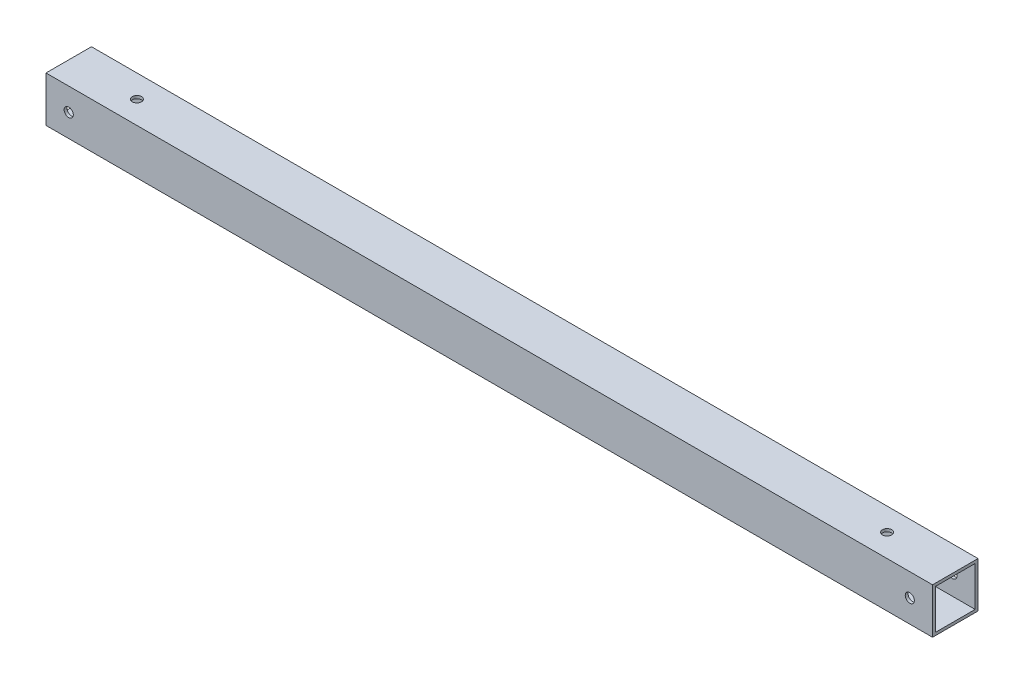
from build123d import *

# Parameters (mm, degrees)
SKETCH1_W                  = 25.4
SKETCH1_H                  = 25.4
SKETCH1_W_2                = 22.225
SKETCH1_H_2                = 22.225
BOSS_EXTRUDE1_DEPTH        = 495.3
F_7_0_201_DIAMETER_HOLE1_D = 5.1054
F_7_0_201_DIAMETER_HOLE2_D = 5.1054


with BuildPart() as part:
    # Sketch1 → Boss-Extrude1 (new body)
    with BuildSketch(Plane(origin=(0, 0, 0), x_dir=(0, 0, -1), z_dir=(1, 0, 0))):
        Rectangle(SKETCH1_W, SKETCH1_H)
        Rectangle(SKETCH1_W_2, SKETCH1_H_2, mode=Mode.SUBTRACT)
    extrude(amount=BOSS_EXTRUDE1_DEPTH)

    # 7 _0.201_ Diameter Hole1 (through all)
    with Locations(Plane(origin=(0, 12.7, 0), x_dir=(1, 0, 0), z_dir=(0, 1, 0))):
        with Locations((38.1, 0), (457.2, 0)):
            Hole(F_7_0_201_DIAMETER_HOLE1_D / 2)

    # 7 _0.201_ Diameter Hole2 (through all)
    with Locations(Plane.XY.offset(12.7)):
        with Locations((482.6, 0), (12.7, 0)):
            Hole(F_7_0_201_DIAMETER_HOLE2_D / 2)


solid = part.part
